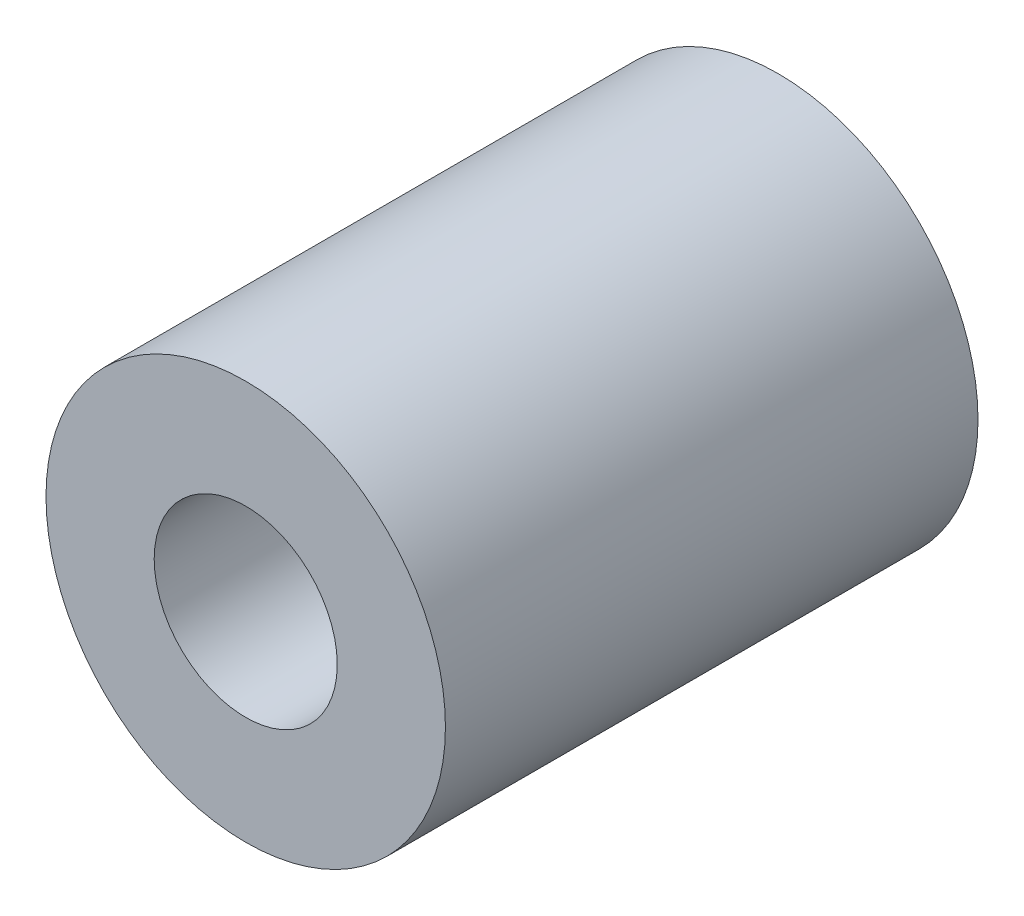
ISO-10303-21;
HEADER;
FILE_DESCRIPTION(('STEP AP214'),'2;1');
FILE_NAME('part.step','',(''),(''),'','','');
FILE_SCHEMA(('AUTOMOTIVE_DESIGN { 1 0 10303 214 1 1 1 1 }'));
ENDSEC;
DATA;
#1=APPLICATION_CONTEXT('core data for automotive mechanical design processes');
#2=APPLICATION_PROTOCOL_DEFINITION('international standard','automotive_design',2000,#1);
#3=PRODUCT_CONTEXT('',#1,'mechanical');
#4=PRODUCT('Part','Part','',(#3));
#5=PRODUCT_RELATED_PRODUCT_CATEGORY('part','',(#4));
#6=PRODUCT_DEFINITION_FORMATION('','',#4);
#7=PRODUCT_DEFINITION_CONTEXT('part definition',#1,'design');
#8=PRODUCT_DEFINITION('design','',#6,#7);
#9=PRODUCT_DEFINITION_SHAPE('','',#8);
#10=(LENGTH_UNIT() NAMED_UNIT(*) SI_UNIT(.MILLI.,.METRE.));
#11=(NAMED_UNIT(*) PLANE_ANGLE_UNIT() SI_UNIT($,.RADIAN.));
#12=(NAMED_UNIT(*) SI_UNIT($,.STERADIAN.) SOLID_ANGLE_UNIT());
#13=UNCERTAINTY_MEASURE_WITH_UNIT(LENGTH_MEASURE(1.E-05),#10,'distance_accuracy_value','');
#14=(GEOMETRIC_REPRESENTATION_CONTEXT(3) GLOBAL_UNCERTAINTY_ASSIGNED_CONTEXT((#13)) GLOBAL_UNIT_ASSIGNED_CONTEXT((#10,
#11,#12)) REPRESENTATION_CONTEXT('',''));
#15=CARTESIAN_POINT('',(0.,0.,0.));
#16=DIRECTION('',(0.,0.,1.));
#17=DIRECTION('',(1.,0.,0.));
#18=AXIS2_PLACEMENT_3D('',#15,#16,#17);
#19=CARTESIAN_POINT('',(0.,0.,16.));
#20=DIRECTION('',(0.,0.,-1.));
#21=DIRECTION('',(-1.,0.,0.));
#22=AXIS2_PLACEMENT_3D('',#19,#20,#21);
#23=CYLINDRICAL_SURFACE('',#22,6.);
#24=CARTESIAN_POINT('',(0.,0.,16.));
#25=DIRECTION('',(0.,0.,1.));
#26=DIRECTION('',(1.,0.,0.));
#27=AXIS2_PLACEMENT_3D('',#24,#25,#26);
#28=CIRCLE('',#27,6.);
#29=CARTESIAN_POINT('',(6.,0.,16.));
#30=VERTEX_POINT('',#29);
#31=EDGE_CURVE('E10',#30,#30,#28,.T.);
#32=ORIENTED_EDGE('',*,*,#31,.F.);
#33=EDGE_LOOP('',(#32));
#34=FACE_BOUND('',#33,.T.);
#35=CARTESIAN_POINT('',(0.,0.,0.));
#36=DIRECTION('',(0.,0.,1.));
#37=DIRECTION('',(1.,0.,0.));
#38=AXIS2_PLACEMENT_3D('',#35,#36,#37);
#39=CIRCLE('',#38,6.);
#40=CARTESIAN_POINT('',(6.,0.,0.));
#41=VERTEX_POINT('',#40);
#42=EDGE_CURVE('E33',#41,#41,#39,.T.);
#43=ORIENTED_EDGE('',*,*,#42,.T.);
#44=EDGE_LOOP('',(#43));
#45=FACE_BOUND('',#44,.T.);
#46=ADVANCED_FACE('F30',(#34,#45),#23,.T.);
#47=CARTESIAN_POINT('',(0.,0.,16.));
#48=DIRECTION('',(0.,0.,1.));
#49=DIRECTION('',(1.,0.,0.));
#50=AXIS2_PLACEMENT_3D('',#47,#48,#49);
#51=PLANE('',#50);
#52=CARTESIAN_POINT('',(0.,0.,16.));
#53=DIRECTION('',(0.,0.,1.));
#54=DIRECTION('',(1.,0.,0.));
#55=AXIS2_PLACEMENT_3D('',#52,#53,#54);
#56=CIRCLE('',#55,2.75);
#57=CARTESIAN_POINT('',(2.75,0.,16.));
#58=VERTEX_POINT('',#57);
#59=EDGE_CURVE('E42',#58,#58,#56,.T.);
#60=ORIENTED_EDGE('',*,*,#59,.F.);
#61=EDGE_LOOP('',(#60));
#62=FACE_BOUND('',#61,.T.);
#63=ORIENTED_EDGE('',*,*,#31,.T.);
#64=EDGE_LOOP('',(#63));
#65=FACE_BOUND('',#64,.T.);
#66=ADVANCED_FACE('F57',(#62,#65),#51,.T.);
#67=CARTESIAN_POINT('',(0.,0.,0.));
#68=DIRECTION('',(0.,0.,1.));
#69=DIRECTION('',(1.,0.,0.));
#70=AXIS2_PLACEMENT_3D('',#67,#68,#69);
#71=PLANE('',#70);
#72=CARTESIAN_POINT('',(0.,0.,0.));
#73=DIRECTION('',(0.,0.,1.));
#74=DIRECTION('',(1.,0.,0.));
#75=AXIS2_PLACEMENT_3D('',#72,#73,#74);
#76=CIRCLE('',#75,2.75);
#77=CARTESIAN_POINT('',(2.75,0.,0.));
#78=VERTEX_POINT('',#77);
#79=EDGE_CURVE('E40',#78,#78,#76,.T.);
#80=ORIENTED_EDGE('',*,*,#79,.T.);
#81=EDGE_LOOP('',(#80));
#82=FACE_BOUND('',#81,.T.);
#83=ORIENTED_EDGE('',*,*,#42,.F.);
#84=EDGE_LOOP('',(#83));
#85=FACE_BOUND('',#84,.T.);
#86=ADVANCED_FACE('F48',(#82,#85),#71,.F.);
#87=CARTESIAN_POINT('',(0.,0.,0.));
#88=DIRECTION('',(0.,0.,1.));
#89=DIRECTION('',(1.,0.,0.));
#90=AXIS2_PLACEMENT_3D('',#87,#88,#89);
#91=CYLINDRICAL_SURFACE('',#90,2.75);
#92=ORIENTED_EDGE('',*,*,#79,.F.);
#93=EDGE_LOOP('',(#92));
#94=FACE_BOUND('',#93,.T.);
#95=ORIENTED_EDGE('',*,*,#59,.T.);
#96=EDGE_LOOP('',(#95));
#97=FACE_BOUND('',#96,.T.);
#98=ADVANCED_FACE('F51',(#94,#97),#91,.F.);
#99=CLOSED_SHELL('',(#46,#66,#86,#98));
#100=MANIFOLD_SOLID_BREP('B2',#99);
#101=ADVANCED_BREP_SHAPE_REPRESENTATION('',(#18,#100),#14);
#102=SHAPE_DEFINITION_REPRESENTATION(#9,#101);
ENDSEC;
END-ISO-10303-21;
